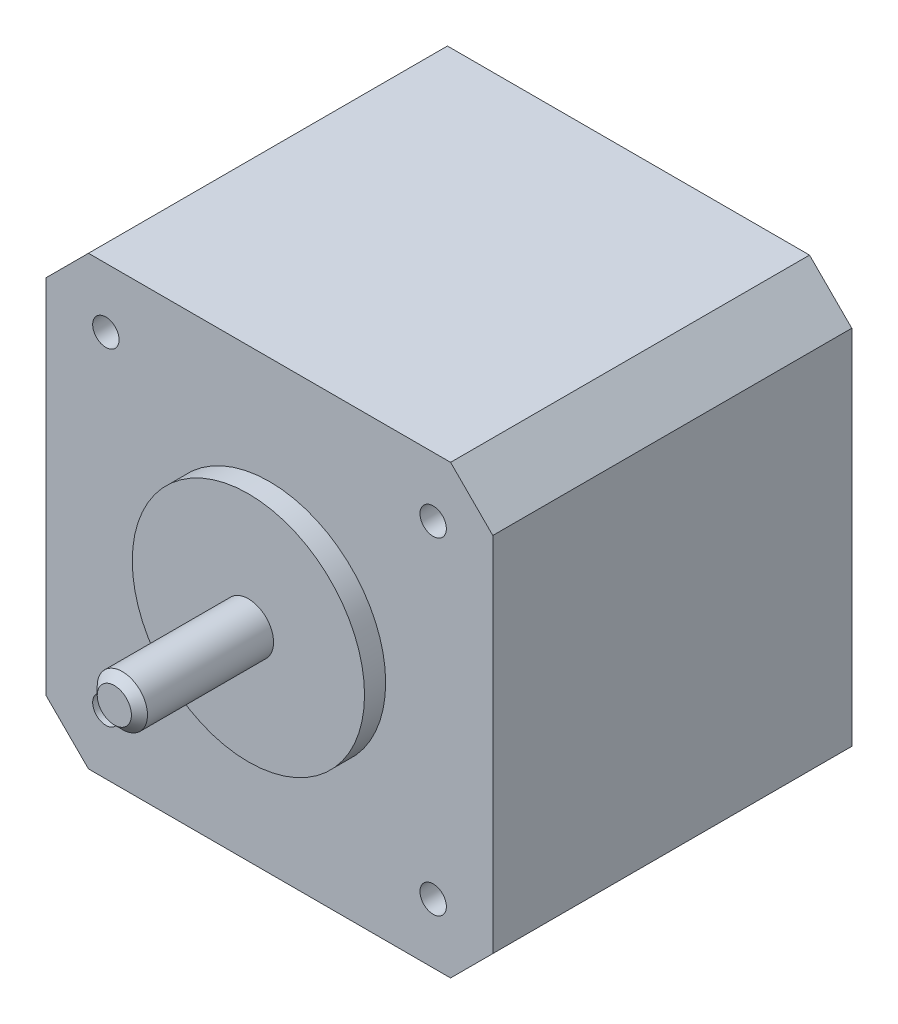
from build123d import *

# Parameters (mm, degrees)
SKETCH1_W           = 42.3
SKETCH1_H           = 42.3
BOSS_EXTRUDE1_DEPTH = 34
CHAMFER1_SIZE       = 4
SKETCH2_R           = 11
BOSS_EXTRUDE2_DEPTH = 2
SKETCH3_R           = 2.38125
BOSS_EXTRUDE3_DEPTH = 12.7
SKETCH4_R           = 1.25
CUT_EXTRUDE1_DEPTH  = 4.5
CHAMFER2_SIZE       = 0.762


with BuildPart() as part:
    # Sketch1 → Boss-Extrude1 (new body)
    with BuildSketch(Plane.XY):
        Rectangle(SKETCH1_W, SKETCH1_H)
    extrude(amount=BOSS_EXTRUDE1_DEPTH)

    # Chamfer1
    chamfer1_edges = [part.edges().sort_by_distance(p)[0] for p in [
        (21.15, -21.15, 17),
        (-21.15, -21.15, 17),
        (-21.15, 21.15, 17),
        (21.15, 21.15, 17),
    ]]
    chamfer(chamfer1_edges, length=CHAMFER1_SIZE)

    # Sketch2 → Boss-Extrude2 (add)
    with BuildSketch(Plane.XY.offset(34)):
        with Locations(Location((0, 0, 0), (0, 0, 180))):
            Circle(SKETCH2_R)
    extrude(amount=BOSS_EXTRUDE2_DEPTH)

    # Sketch3 → Boss-Extrude3 (add)
    with BuildSketch(Plane.XY.offset(36)):
        Circle(SKETCH3_R)
    extrude(amount=BOSS_EXTRUDE3_DEPTH)

    # Sketch4 → Cut-Extrude1 (cut)
    with BuildSketch(Plane.XY.offset(34)):
        with Locations((-15.5, 15.5)):
            Circle(SKETCH4_R)
        with Locations(Location((15.5, 15.5, 0), (0, 0, 180))):
            Circle(SKETCH4_R)
        with Locations((15.5, -15.5)):
            Circle(SKETCH4_R)
        with Locations(Location((-15.5, -15.5, 0), (0, 0, 180))):
            Circle(SKETCH4_R)
    extrude(amount=-CUT_EXTRUDE1_DEPTH, mode=Mode.SUBTRACT)

    # Chamfer2
    chamfer2_edges = [part.edges().sort_by_distance(p)[0] for p in [
        (-2.38125, 0, 48.7),
    ]]
    chamfer(chamfer2_edges, length=CHAMFER2_SIZE)


solid = part.part
